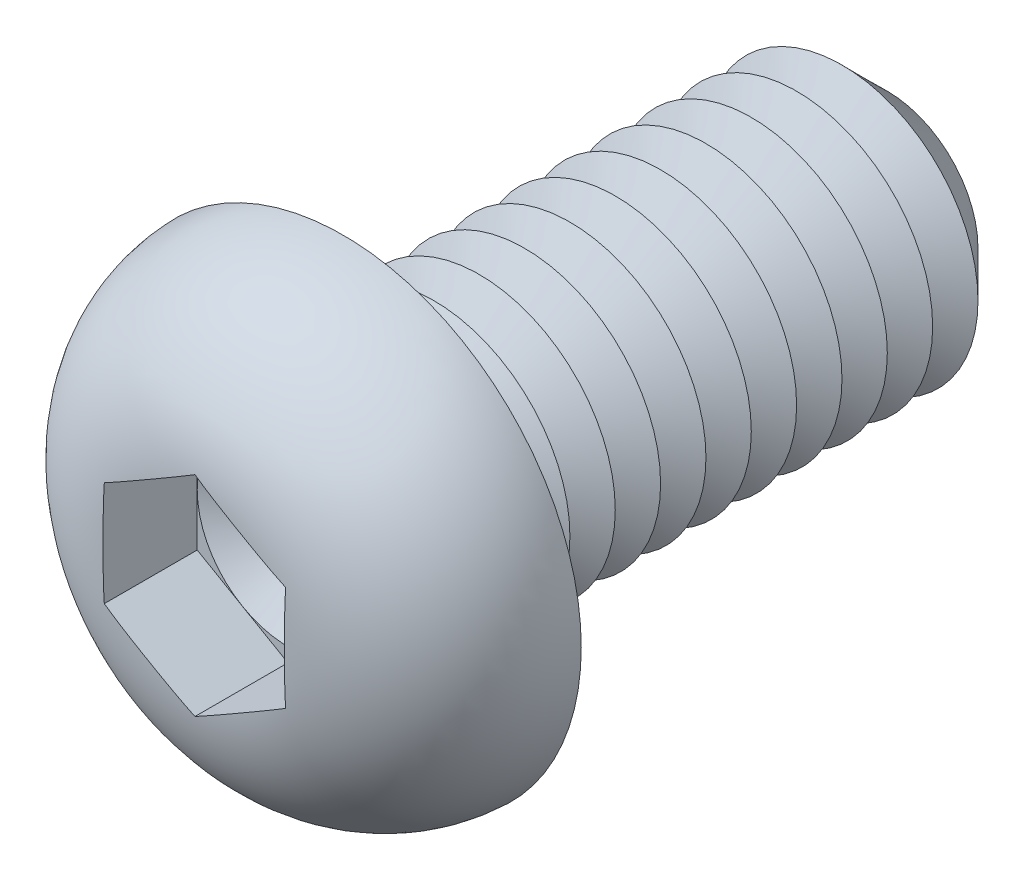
ISO-10303-21;
HEADER;
FILE_DESCRIPTION(('STEP AP214'),'2;1');
FILE_NAME('part.step','',(''),(''),'','','');
FILE_SCHEMA(('AUTOMOTIVE_DESIGN { 1 0 10303 214 1 1 1 1 }'));
ENDSEC;
DATA;
#1=APPLICATION_CONTEXT('core data for automotive mechanical design processes');
#2=APPLICATION_PROTOCOL_DEFINITION('international standard','automotive_design',2000,#1);
#3=PRODUCT_CONTEXT('',#1,'mechanical');
#4=PRODUCT('Part','Part','',(#3));
#5=PRODUCT_RELATED_PRODUCT_CATEGORY('part','',(#4));
#6=PRODUCT_DEFINITION_FORMATION('','',#4);
#7=PRODUCT_DEFINITION_CONTEXT('part definition',#1,'design');
#8=PRODUCT_DEFINITION('design','',#6,#7);
#9=PRODUCT_DEFINITION_SHAPE('','',#8);
#10=(LENGTH_UNIT() NAMED_UNIT(*) SI_UNIT(.MILLI.,.METRE.));
#11=(NAMED_UNIT(*) PLANE_ANGLE_UNIT() SI_UNIT($,.RADIAN.));
#12=(NAMED_UNIT(*) SI_UNIT($,.STERADIAN.) SOLID_ANGLE_UNIT());
#13=UNCERTAINTY_MEASURE_WITH_UNIT(LENGTH_MEASURE(1.E-05),#10,'distance_accuracy_value','');
#14=(GEOMETRIC_REPRESENTATION_CONTEXT(3) GLOBAL_UNCERTAINTY_ASSIGNED_CONTEXT((#13)) GLOBAL_UNIT_ASSIGNED_CONTEXT((#10,
#11,#12)) REPRESENTATION_CONTEXT('',''));
#15=CARTESIAN_POINT('',(0.,0.,0.));
#16=DIRECTION('',(0.,0.,1.));
#17=DIRECTION('',(1.,0.,0.));
#18=AXIS2_PLACEMENT_3D('',#15,#16,#17);
#19=CARTESIAN_POINT('',(0.,0.,1.22));
#20=DIRECTION('',(0.,0.,1.));
#21=DIRECTION('',(1.,0.,0.));
#22=AXIS2_PLACEMENT_3D('',#19,#20,#21);
#23=PLANE('',#22);
#24=CARTESIAN_POINT('',(0.,0.,1.22));
#25=DIRECTION('',(0.,0.,1.));
#26=DIRECTION('',(1.,0.,0.));
#27=AXIS2_PLACEMENT_3D('',#24,#25,#26);
#28=CIRCLE('',#27,2.);
#29=CARTESIAN_POINT('',(2.,0.,1.22));
#30=VERTEX_POINT('',#29);
#31=CARTESIAN_POINT('',(1.,1.73205080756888,1.22));
#32=VERTEX_POINT('',#31);
#33=EDGE_CURVE('E117',#30,#32,#28,.T.);
#34=ORIENTED_EDGE('',*,*,#33,.F.);
#35=DIRECTION('',(0.,1.,0.));
#36=VECTOR('',#35,1.);
#37=CARTESIAN_POINT('',(2.,-1.15470053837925,1.22));
#38=LINE('',#37,#36);
#39=CARTESIAN_POINT('',(2.,1.15470053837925,1.22));
#40=VERTEX_POINT('',#39);
#41=EDGE_CURVE('E140',#30,#40,#38,.T.);
#42=ORIENTED_EDGE('',*,*,#41,.T.);
#43=DIRECTION('',(-0.866025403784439,0.5,0.));
#44=VECTOR('',#43,1.);
#45=CARTESIAN_POINT('',(2.,1.15470053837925,1.22));
#46=LINE('',#45,#44);
#47=EDGE_CURVE('E136',#40,#32,#46,.T.);
#48=ORIENTED_EDGE('',*,*,#47,.T.);
#49=EDGE_LOOP('',(#34,#42,#48));
#50=FACE_BOUND('',#49,.T.);
#51=ADVANCED_FACE('F39',(#50),#23,.T.);
#52=CARTESIAN_POINT('',(0.,0.,1.22));
#53=DIRECTION('',(0.,0.,1.));
#54=DIRECTION('',(1.,0.,0.));
#55=AXIS2_PLACEMENT_3D('',#52,#53,#54);
#56=CIRCLE('',#55,2.);
#57=CARTESIAN_POINT('',(-1.,1.73205080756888,1.22));
#58=VERTEX_POINT('',#57);
#59=EDGE_CURVE('E11',#32,#58,#56,.T.);
#60=ORIENTED_EDGE('',*,*,#59,.F.);
#61=CARTESIAN_POINT('',(0.,2.3094010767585,1.22));
#62=VERTEX_POINT('',#61);
#63=EDGE_CURVE('E130',#32,#62,#46,.T.);
#64=ORIENTED_EDGE('',*,*,#63,.T.);
#65=DIRECTION('',(-0.866025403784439,-0.5,0.));
#66=VECTOR('',#65,1.);
#67=CARTESIAN_POINT('',(0.,2.3094010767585,1.22));
#68=LINE('',#67,#66);
#69=EDGE_CURVE('E131',#62,#58,#68,.T.);
#70=ORIENTED_EDGE('',*,*,#69,.T.);
#71=EDGE_LOOP('',(#60,#64,#70));
#72=FACE_BOUND('',#71,.T.);
#73=ADVANCED_FACE('F129',(#72),#23,.T.);
#74=CARTESIAN_POINT('',(-2.,0.,1.22));
#75=VERTEX_POINT('',#74);
#76=EDGE_CURVE('E49',#58,#75,#56,.T.);
#77=ORIENTED_EDGE('',*,*,#76,.F.);
#78=CARTESIAN_POINT('',(-2.,1.15470053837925,1.22));
#79=VERTEX_POINT('',#78);
#80=EDGE_CURVE('E143',#58,#79,#68,.T.);
#81=ORIENTED_EDGE('',*,*,#80,.T.);
#82=DIRECTION('',(0.,-1.,0.));
#83=VECTOR('',#82,1.);
#84=CARTESIAN_POINT('',(-2.,1.15470053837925,1.22));
#85=LINE('',#84,#83);
#86=EDGE_CURVE('E153',#79,#75,#85,.T.);
#87=ORIENTED_EDGE('',*,*,#86,.T.);
#88=EDGE_LOOP('',(#77,#81,#87));
#89=FACE_BOUND('',#88,.T.);
#90=ADVANCED_FACE('F270',(#89),#23,.T.);
#91=CARTESIAN_POINT('',(-1.,-1.73205080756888,1.22));
#92=VERTEX_POINT('',#91);
#93=EDGE_CURVE('E254',#75,#92,#56,.T.);
#94=ORIENTED_EDGE('',*,*,#93,.F.);
#95=CARTESIAN_POINT('',(-2.,-1.15470053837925,1.22));
#96=VERTEX_POINT('',#95);
#97=EDGE_CURVE('E152',#75,#96,#85,.T.);
#98=ORIENTED_EDGE('',*,*,#97,.T.);
#99=DIRECTION('',(0.866025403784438,-0.5,0.));
#100=VECTOR('',#99,1.);
#101=CARTESIAN_POINT('',(-2.,-1.15470053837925,1.22));
#102=LINE('',#101,#100);
#103=EDGE_CURVE('E158',#96,#92,#102,.T.);
#104=ORIENTED_EDGE('',*,*,#103,.T.);
#105=EDGE_LOOP('',(#94,#98,#104));
#106=FACE_BOUND('',#105,.T.);
#107=ADVANCED_FACE('F264',(#106),#23,.T.);
#108=CARTESIAN_POINT('',(0.999999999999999,-1.73205080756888,1.22));
#109=VERTEX_POINT('',#108);
#110=EDGE_CURVE('E56',#92,#109,#56,.T.);
#111=ORIENTED_EDGE('',*,*,#110,.F.);
#112=CARTESIAN_POINT('',(0.,-2.3094010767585,1.22));
#113=VERTEX_POINT('',#112);
#114=EDGE_CURVE('E157',#92,#113,#102,.T.);
#115=ORIENTED_EDGE('',*,*,#114,.T.);
#116=DIRECTION('',(0.866025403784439,0.5,0.));
#117=VECTOR('',#116,1.);
#118=CARTESIAN_POINT('',(0.,-2.3094010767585,1.22));
#119=LINE('',#118,#117);
#120=EDGE_CURVE('E163',#113,#109,#119,.T.);
#121=ORIENTED_EDGE('',*,*,#120,.T.);
#122=EDGE_LOOP('',(#111,#115,#121));
#123=FACE_BOUND('',#122,.T.);
#124=ADVANCED_FACE('F306',(#123),#23,.T.);
#125=CARTESIAN_POINT('',(0.,0.,-12.));
#126=DIRECTION('',(0.,0.,1.));
#127=DIRECTION('',(1.,0.,0.));
#128=AXIS2_PLACEMENT_3D('',#125,#126,#127);
#129=CYLINDRICAL_SURFACE('',#128,3.);
#130=CARTESIAN_POINT('',(0.,0.,-0.5));
#131=DIRECTION('',(0.,0.,1.));
#132=DIRECTION('',(1.,0.,0.));
#133=AXIS2_PLACEMENT_3D('',#130,#131,#132);
#134=CIRCLE('',#133,3.);
#135=CARTESIAN_POINT('',(3.,0.,-0.5));
#136=VERTEX_POINT('',#135);
#137=EDGE_CURVE('E242',#136,#136,#134,.F.);
#138=ORIENTED_EDGE('',*,*,#137,.T.);
#139=EDGE_LOOP('',(#138));
#140=FACE_BOUND('',#139,.T.);
#141=CARTESIAN_POINT('',(0.,0.,-1.));
#142=DIRECTION('',(0.,0.,1.));
#143=DIRECTION('',(1.,0.,0.));
#144=AXIS2_PLACEMENT_3D('',#141,#142,#143);
#145=CIRCLE('',#144,3.00000000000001);
#146=CARTESIAN_POINT('',(3.00000000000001,0.,-1.));
#147=VERTEX_POINT('',#146);
#148=EDGE_CURVE('E138',#147,#147,#145,.T.);
#149=ORIENTED_EDGE('',*,*,#148,.T.);
#150=EDGE_LOOP('',(#149));
#151=FACE_BOUND('',#150,.T.);
#152=ADVANCED_FACE('F307',(#140,#151),#129,.T.);
#153=CARTESIAN_POINT('',(0.,5.25,0.));
#154=DIRECTION('',(0.,0.,1.));
#155=DIRECTION('',(1.,0.,0.));
#156=AXIS2_PLACEMENT_3D('',#153,#154,#155);
#157=PLANE('',#156);
#158=CARTESIAN_POINT('',(0.,0.,0.));
#159=DIRECTION('',(0.,0.,1.));
#160=DIRECTION('',(1.,0.,0.));
#161=AXIS2_PLACEMENT_3D('',#158,#159,#160);
#162=CIRCLE('',#161,3.5);
#163=CARTESIAN_POINT('',(3.5,0.,0.));
#164=VERTEX_POINT('',#163);
#165=EDGE_CURVE('E245',#164,#164,#162,.T.);
#166=ORIENTED_EDGE('',*,*,#165,.T.);
#167=EDGE_LOOP('',(#166));
#168=FACE_BOUND('',#167,.T.);
#169=CARTESIAN_POINT('',(0.,0.,0.));
#170=DIRECTION('',(0.,0.,1.));
#171=DIRECTION('',(1.,0.,0.));
#172=AXIS2_PLACEMENT_3D('',#169,#170,#171);
#173=CIRCLE('',#172,5.25);
#174=CARTESIAN_POINT('',(5.25,0.,0.));
#175=VERTEX_POINT('',#174);
#176=EDGE_CURVE('E174',#175,#175,#173,.T.);
#177=ORIENTED_EDGE('',*,*,#176,.F.);
#178=EDGE_LOOP('',(#177));
#179=FACE_BOUND('',#178,.T.);
#180=ADVANCED_FACE('F310',(#168,#179),#157,.F.);
#181=CARTESIAN_POINT('',(0.,0.,-0.0999999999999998));
#182=DIRECTION('',(0.,0.,1.));
#183=DIRECTION('',(1.,0.,0.));
#184=AXIS2_PLACEMENT_3D('',#181,#182,#183);
#185=DEGENERATE_TOROIDAL_SURFACE('',#184,1.85147090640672,3.4,.T.);
#186=CARTESIAN_POINT('',(-2.0002,1.15458506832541,3.26900492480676));
#187=CARTESIAN_POINT('',(-1.91694658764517,1.20265144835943,3.27552708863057));
#188=CARTESIAN_POINT('',(-1.83362001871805,1.25076006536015,3.28041849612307));
#189=CARTESIAN_POINT('',(-1.66691146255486,1.34700929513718,3.28784569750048));
#190=CARTESIAN_POINT('',(-1.58352950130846,1.39514989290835,3.29038223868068));
#191=CARTESIAN_POINT('',(-1.4167967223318,1.49141310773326,3.29400753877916));
#192=CARTESIAN_POINT('',(-1.33344591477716,1.5395357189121,3.29509714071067));
#193=CARTESIAN_POINT('',(-1.16673007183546,1.63578915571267,3.29647051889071));
#194=CARTESIAN_POINT('',(-1.08336503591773,1.68391998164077,3.29675420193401));
#195=CARTESIAN_POINT('',(-0.916634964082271,1.78018163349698,3.29675420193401));
#196=CARTESIAN_POINT('',(-0.833269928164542,1.82831245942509,3.29647051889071));
#197=CARTESIAN_POINT('',(-0.666554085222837,1.92456589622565,3.29509714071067));
#198=CARTESIAN_POINT('',(-0.583203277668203,1.9726885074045,3.29400753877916));
#199=CARTESIAN_POINT('',(-0.416470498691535,2.06895172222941,3.29038223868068));
#200=CARTESIAN_POINT('',(-0.333088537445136,2.11709232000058,3.28784569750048));
#201=CARTESIAN_POINT('',(-0.166379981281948,2.21334154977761,3.28041849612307));
#202=CARTESIAN_POINT('',(-0.0830534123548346,2.26145016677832,3.27552708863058));
#203=CARTESIAN_POINT('',(0.000200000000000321,2.30951654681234,3.26900492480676));
#204=B_SPLINE_CURVE_WITH_KNOTS('',3,(#186,#187,#188,#189,#190,#191,#192,#193,#194,#195,#196,
#197,#198,#199,#200,#201,#202,#203),.UNSPECIFIED.,.F.,.F.,(4,2,2,2,2,2,2,2,4),(0.,
0.289010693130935,0.57792963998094,0.866680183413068,1.15546411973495,1.44424805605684,
1.73299859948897,2.02191754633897,2.31092823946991),.UNSPECIFIED.);
#205=CARTESIAN_POINT('',(-2.,1.15470053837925,3.26902062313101));
#206=VERTEX_POINT('',#205);
#207=CARTESIAN_POINT('',(1.70733705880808E-11,2.30940107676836,3.2690206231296));
#208=VERTEX_POINT('',#207);
#209=EDGE_CURVE('E196',#206,#208,#204,.T.);
#210=ORIENTED_EDGE('',*,*,#209,.T.);
#211=CARTESIAN_POINT('',(-0.000199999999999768,2.30951654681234,3.26900492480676));
#212=CARTESIAN_POINT('',(0.0830534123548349,2.26145016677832,3.27552708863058));
#213=CARTESIAN_POINT('',(0.166379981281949,2.21334154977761,3.28041849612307));
#214=CARTESIAN_POINT('',(0.333088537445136,2.11709232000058,3.28784569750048));
#215=CARTESIAN_POINT('',(0.416470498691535,2.06895172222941,3.29038223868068));
#216=CARTESIAN_POINT('',(0.583203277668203,1.9726885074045,3.29400753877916));
#217=CARTESIAN_POINT('',(0.666554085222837,1.92456589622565,3.29509714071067));
#218=CARTESIAN_POINT('',(0.833269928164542,1.82831245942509,3.29647051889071));
#219=CARTESIAN_POINT('',(0.916634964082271,1.78018163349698,3.29675420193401));
#220=CARTESIAN_POINT('',(1.08336503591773,1.68391998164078,3.29675420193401));
#221=CARTESIAN_POINT('',(1.16673007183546,1.63578915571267,3.29647051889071));
#222=CARTESIAN_POINT('',(1.33344591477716,1.5395357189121,3.29509714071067));
#223=CARTESIAN_POINT('',(1.4167967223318,1.49141310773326,3.29400753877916));
#224=CARTESIAN_POINT('',(1.58352950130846,1.39514989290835,3.29038223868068));
#225=CARTESIAN_POINT('',(1.66691146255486,1.34700929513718,3.28784569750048));
#226=CARTESIAN_POINT('',(1.83362001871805,1.25076006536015,3.28041849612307));
#227=CARTESIAN_POINT('',(1.91694658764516,1.20265144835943,3.27552708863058));
#228=CARTESIAN_POINT('',(2.0002,1.15458506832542,3.26900492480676));
#229=B_SPLINE_CURVE_WITH_KNOTS('',3,(#211,#212,#213,#214,#215,#216,#217,#218,#219,#220,#221,
#222,#223,#224,#225,#226,#227,#228),.UNSPECIFIED.,.F.,.F.,(4,2,2,2,2,2,2,2,4),(0.,
0.289010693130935,0.577929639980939,0.866680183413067,1.15546411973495,1.44424805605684,
1.73299859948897,2.02191754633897,2.31092823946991),.UNSPECIFIED.);
#230=CARTESIAN_POINT('',(2.,1.15470053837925,3.26902062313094));
#231=VERTEX_POINT('',#230);
#232=EDGE_CURVE('E225',#208,#231,#229,.T.);
#233=ORIENTED_EDGE('',*,*,#232,.T.);
#234=CARTESIAN_POINT('',(2.,0.,3.29675420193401));
#235=CARTESIAN_POINT('',(2.,-0.0838690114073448,3.29675159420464));
#236=CARTESIAN_POINT('',(2.,-0.167737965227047,3.29653427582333));
#237=CARTESIAN_POINT('',(2.,-0.335473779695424,3.29552217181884));
#238=CARTESIAN_POINT('',(2.,-0.419340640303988,3.29472737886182));
#239=CARTESIAN_POINT('',(2.,-0.587092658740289,3.29218243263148));
#240=CARTESIAN_POINT('',(2.,-0.670977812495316,3.29043194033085));
#241=CARTESIAN_POINT('',(2.,-0.838702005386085,3.28542814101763));
#242=CARTESIAN_POINT('',(2.,-0.922541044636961,3.28217483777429));
#243=CARTESIAN_POINT('',(2.,-1.173343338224,3.26923984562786));
#244=CARTESIAN_POINT('',(2.,-1.34017699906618,3.25638268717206));
#245=CARTESIAN_POINT('',(2.,-1.67225876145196,3.21731215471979));
#246=CARTESIAN_POINT('',(2.,-1.83750825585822,3.19111187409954));
#247=CARTESIAN_POINT('',(2.,-2.10571503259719,3.13417573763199));
#248=CARTESIAN_POINT('',(2.,-2.20973442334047,3.10844622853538));
#249=CARTESIAN_POINT('',(2.,-2.41562153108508,3.04936015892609));
#250=CARTESIAN_POINT('',(2.,-2.51748898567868,3.01600267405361));
#251=CARTESIAN_POINT('',(2.,-2.71832295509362,2.94120377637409));
#252=CARTESIAN_POINT('',(2.,-2.81728700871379,2.89975572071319));
#253=CARTESIAN_POINT('',(2.,-3.01134256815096,2.80859624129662));
#254=CARTESIAN_POINT('',(2.,-3.10643425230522,2.75888519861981));
#255=CARTESIAN_POINT('',(2.,-3.29253530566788,2.65079509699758));
#256=CARTESIAN_POINT('',(2.,-3.38350832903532,2.59235327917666));
#257=CARTESIAN_POINT('',(2.,-3.55964478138,2.46728791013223));
#258=CARTESIAN_POINT('',(2.,-3.64480873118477,2.40066509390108));
#259=CARTESIAN_POINT('',(2.,-3.80840353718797,2.25961603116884));
#260=CARTESIAN_POINT('',(2.,-3.88683504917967,2.18519054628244));
#261=CARTESIAN_POINT('',(2.,-4.03608847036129,2.02906828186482));
#262=CARTESIAN_POINT('',(2.,-4.106911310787,1.94737239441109));
#263=CARTESIAN_POINT('',(2.,-4.23287471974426,1.78665318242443));
#264=CARTESIAN_POINT('',(2.,-4.2888832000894,1.7083085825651));
#265=CARTESIAN_POINT('',(2.,-4.39372062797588,1.54691061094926));
#266=CARTESIAN_POINT('',(2.,-4.44254705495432,1.46385560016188));
#267=CARTESIAN_POINT('',(2.,-4.53249771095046,1.29375158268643));
#268=CARTESIAN_POINT('',(2.,-4.57362814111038,1.20670586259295));
#269=CARTESIAN_POINT('',(2.,-4.6478549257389,1.02924414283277));
#270=CARTESIAN_POINT('',(2.,-4.68094842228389,0.938826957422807));
#271=CARTESIAN_POINT('',(2.,-4.76413649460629,0.674747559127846));
#272=CARTESIAN_POINT('',(2.,-4.80368573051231,0.497625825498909));
#273=CARTESIAN_POINT('',(2.,-4.85179982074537,0.13932226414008));
#274=CARTESIAN_POINT('',(2.,-4.86036774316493,-0.0418591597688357));
#275=CARTESIAN_POINT('',(2.,-4.84642577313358,-0.399473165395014));
#276=CARTESIAN_POINT('',(2.,-4.82452156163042,-0.575929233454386));
#277=CARTESIAN_POINT('',(2.,-4.75142809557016,-0.922615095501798));
#278=CARTESIAN_POINT('',(2.,-4.70024536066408,-1.09284626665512));
#279=CARTESIAN_POINT('',(2.,-4.57020203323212,-1.42258491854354));
#280=CARTESIAN_POINT('',(2.,-4.49131097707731,-1.58208036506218));
#281=CARTESIAN_POINT('',(2.,-4.3083542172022,-1.8860021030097));
#282=CARTESIAN_POINT('',(2.,-4.2042742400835,-2.03041978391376));
#283=CARTESIAN_POINT('',(2.,-3.97174533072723,-2.30354399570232));
#284=CARTESIAN_POINT('',(2.,-3.84281347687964,-2.43183812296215));
#285=CARTESIAN_POINT('',(2.,-3.56631740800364,-2.66612298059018));
#286=CARTESIAN_POINT('',(2.,-3.41877418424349,-2.77213848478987));
#287=CARTESIAN_POINT('',(2.,-3.18261597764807,-2.91604941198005));
#288=CARTESIAN_POINT('',(2.,-3.09905663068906,-2.96247915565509));
#289=CARTESIAN_POINT('',(2.,-2.92856838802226,-3.04879370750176));
#290=CARTESIAN_POINT('',(2.,-2.84163827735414,-3.08867612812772));
#291=CARTESIAN_POINT('',(2.,-2.66495003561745,-3.16199567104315));
#292=CARTESIAN_POINT('',(2.,-2.57518752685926,-3.19542218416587));
#293=CARTESIAN_POINT('',(2.,-2.3936698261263,-3.25594506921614));
#294=CARTESIAN_POINT('',(2.,-2.30191676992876,-3.28304789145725));
#295=CARTESIAN_POINT('',(2.,-2.07265810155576,-3.34285611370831));
#296=CARTESIAN_POINT('',(2.,-1.93423373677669,-3.37205334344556));
#297=CARTESIAN_POINT('',(2.,-1.65546420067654,-3.419280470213));
#298=CARTESIAN_POINT('',(2.,-1.51511762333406,-3.43730169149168));
#299=CARTESIAN_POINT('',(2.,-1.23291689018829,-3.46473877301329));
#300=CARTESIAN_POINT('',(2.,-1.09105869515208,-3.47411015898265));
#301=CARTESIAN_POINT('',(2.,-0.807138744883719,-3.48717303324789));
#302=CARTESIAN_POINT('',(2.,-0.665077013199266,-3.4908651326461));
#303=CARTESIAN_POINT('',(2.,-0.451303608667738,-3.49429675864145));
#304=CARTESIAN_POINT('',(2.,-0.379602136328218,-3.49508825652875));
#305=CARTESIAN_POINT('',(2.,-0.236195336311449,-3.49619580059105));
#306=CARTESIAN_POINT('',(2.,-0.164490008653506,-3.49651184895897));
#307=CARTESIAN_POINT('',(2.,-0.0210718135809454,-3.49680708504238));
#308=CARTESIAN_POINT('',(2.,0.0506410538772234,-3.49678623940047));
#309=CARTESIAN_POINT('',(2.,0.194065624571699,-3.49639104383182));
#310=CARTESIAN_POINT('',(2.,0.265777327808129,-3.49601669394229));
#311=CARTESIAN_POINT('',(2.,0.480501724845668,-3.4941697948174));
#312=CARTESIAN_POINT('',(2.,0.623510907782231,-3.49197539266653));
#313=CARTESIAN_POINT('',(2.,0.909378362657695,-3.48318258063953));
#314=CARTESIAN_POINT('',(2.,1.05223667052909,-3.47658576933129));
#315=CARTESIAN_POINT('',(2.,1.30726724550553,-3.45800282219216));
#316=CARTESIAN_POINT('',(2.,1.41953767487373,-3.44745204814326));
#317=CARTESIAN_POINT('',(2.,1.64336701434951,-3.42020385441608));
#318=CARTESIAN_POINT('',(2.,1.75492585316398,-3.40350582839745));
#319=CARTESIAN_POINT('',(2.,1.97590795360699,-3.36293007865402));
#320=CARTESIAN_POINT('',(2.,2.08534088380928,-3.33910600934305));
#321=CARTESIAN_POINT('',(2.,2.30216001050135,-3.28336687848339));
#322=CARTESIAN_POINT('',(2.,2.40954602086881,-3.25145108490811));
#323=CARTESIAN_POINT('',(2.,2.62289868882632,-3.1784271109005));
#324=CARTESIAN_POINT('',(2.,2.72882262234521,-3.13719314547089));
#325=CARTESIAN_POINT('',(2.,2.93660837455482,-3.04548652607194));
#326=CARTESIAN_POINT('',(2.,3.03847031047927,-2.99501413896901));
#327=CARTESIAN_POINT('',(2.,3.23738754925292,-2.88459171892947));
#328=CARTESIAN_POINT('',(2.,3.33442546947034,-2.82461027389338));
#329=CARTESIAN_POINT('',(2.,3.52225616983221,-2.69545434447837));
#330=CARTESIAN_POINT('',(2.,3.61304636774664,-2.62627609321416));
#331=CARTESIAN_POINT('',(2.,3.77958578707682,-2.48563135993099));
#332=CARTESIAN_POINT('',(2.,3.85595570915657,-2.41489922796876));
#333=CARTESIAN_POINT('',(2.,4.00175744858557,-2.26661746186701));
#334=CARTESIAN_POINT('',(2.,4.07118992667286,-2.18906847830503));
#335=CARTESIAN_POINT('',(2.,4.20228235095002,-2.02784942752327));
#336=CARTESIAN_POINT('',(2.,4.26395450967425,-1.94418931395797));
#337=CARTESIAN_POINT('',(2.,4.37897455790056,-1.7713710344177));
#338=CARTESIAN_POINT('',(2.,4.43232318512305,-1.68221335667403));
#339=CARTESIAN_POINT('',(2.,4.5685109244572,-1.42722170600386));
#340=CARTESIAN_POINT('',(2.,4.64167742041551,-1.25607726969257));
#341=CARTESIAN_POINT('',(2.,4.75695354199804,-0.903699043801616));
#342=CARTESIAN_POINT('',(2.,4.79906366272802,-0.722465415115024));
#343=CARTESIAN_POINT('',(2.,4.84982785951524,-0.362243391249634));
#344=CARTESIAN_POINT('',(2.,4.85966759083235,-0.183422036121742));
#345=CARTESIAN_POINT('',(2.,4.84889099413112,0.17327689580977));
#346=CARTESIAN_POINT('',(2.,4.82827907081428,0.351154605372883));
#347=CARTESIAN_POINT('',(2.,4.75760776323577,0.699332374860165));
#348=CARTESIAN_POINT('',(2.,4.70780624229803,0.869684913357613));
#349=CARTESIAN_POINT('',(2.,4.58058971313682,1.199716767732));
#350=CARTESIAN_POINT('',(2.,4.50317623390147,1.35939667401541));
#351=CARTESIAN_POINT('',(2.,4.32230037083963,1.66542907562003));
#352=CARTESIAN_POINT('',(2.,4.21858077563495,1.81162931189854));
#353=CARTESIAN_POINT('',(2.,3.98879583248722,2.08527000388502));
#354=CARTESIAN_POINT('',(2.,3.86272429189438,2.21270524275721));
#355=CARTESIAN_POINT('',(2.,3.58743550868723,2.45020985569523));
#356=CARTESIAN_POINT('',(2.,3.43756474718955,2.55951924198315));
#357=CARTESIAN_POINT('',(2.,3.12282273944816,2.7535430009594));
#358=CARTESIAN_POINT('',(2.,2.95795742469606,2.83826704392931));
#359=CARTESIAN_POINT('',(2.,2.67096435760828,2.96064273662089));
#360=CARTESIAN_POINT('',(2.,2.55150855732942,3.00473766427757));
#361=CARTESIAN_POINT('',(2.,2.30905936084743,3.08191633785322));
#362=CARTESIAN_POINT('',(2.,2.18606487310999,3.11499664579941));
#363=CARTESIAN_POINT('',(2.,1.93761764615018,3.17114962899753));
#364=CARTESIAN_POINT('',(2.,1.8121607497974,3.19420352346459));
#365=CARTESIAN_POINT('',(2.,1.56000755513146,3.23170431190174));
#366=CARTESIAN_POINT('',(2.,1.43331126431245,3.24615125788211));
#367=CARTESIAN_POINT('',(2.,1.19785080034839,3.26676473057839));
#368=CARTESIAN_POINT('',(2.,1.08915974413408,3.27383022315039));
#369=CARTESIAN_POINT('',(2.,0.87159878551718,3.28448481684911));
#370=CARTESIAN_POINT('',(2.,0.762728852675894,3.28807324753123));
#371=CARTESIAN_POINT('',(2.,0.54488171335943,3.29312180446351));
#372=CARTESIAN_POINT('',(2.,0.435904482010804,3.29458062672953));
#373=CARTESIAN_POINT('',(2.,0.217951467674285,3.29639847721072));
#374=CARTESIAN_POINT('',(2.,0.108975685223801,3.29675759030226));
#375=CARTESIAN_POINT('',(2.,0.,3.29675420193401));
#376=B_SPLINE_CURVE_WITH_KNOTS('',3,(#234,#235,#236,#237,#238,#239,#240,#241,#242,#243,#244,
#245,#246,#247,#248,#249,#250,#251,#252,#253,#254,#255,#256,#257,#258,#259,#260,#261,#262,#263,
#264,#265,#266,#267,#268,#269,#270,#271,#272,#273,#274,#275,#276,#277,#278,#279,#280,#281,#282,
#283,#284,#285,#286,#287,#288,#289,#290,#291,#292,#293,#294,#295,#296,#297,#298,#299,#300,#301,
#302,#303,#304,#305,#306,#307,#308,#309,#310,#311,#312,#313,#314,#315,#316,#317,#318,#319,#320,
#321,#322,#323,#324,#325,#326,#327,#328,#329,#330,#331,#332,#333,#334,#335,#336,#337,#338,#339,
#340,#341,#342,#343,#344,#345,#346,#347,#348,#349,#350,#351,#352,#353,#354,#355,#356,#357,#358,
#359,#360,#361,#362,#363,#364,#365,#366,#367,#368,#369,#370,#371,#372,#373,#374,#375),
.UNSPECIFIED.,.T.,.F.,(4,2,2,2,2,2,2,2,2,2,2,2,2,2,2,2,2,2,2,2,2,2,2,2,2,2,2,2,2,2,2,2,2,2,2,2,
2,2,2,2,2,2,2,2,2,2,2,2,2,2,2,2,2,2,2,2,2,2,2,2,2,2,2,2,2,2,2,2,2,2,4),(0.,0.251606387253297,
0.503215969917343,0.754914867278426,1.00661313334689,1.50825543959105,2.00940643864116,
2.33061510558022,2.65186271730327,2.97337521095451,3.29487288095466,3.61880390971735,
3.94270585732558,4.26657621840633,4.59040689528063,4.8789527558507,5.16759964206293,
5.45601293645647,5.74452864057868,6.28608750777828,6.82759274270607,7.35848716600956,
7.8892634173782,8.42062506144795,8.95228851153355,9.49557283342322,10.0382497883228,
10.3247866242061,10.6114277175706,10.8985359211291,11.1853499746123,11.6091713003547,
12.0333212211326,12.4596400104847,12.8859129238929,13.1010304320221,13.316146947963,
13.5312847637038,13.746422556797,14.1754765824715,14.6043748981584,14.9425387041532,
15.2807358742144,15.6164481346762,15.9521907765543,16.2927694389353,16.6333382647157,
16.9750565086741,17.3169151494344,17.6287548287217,17.9405647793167,18.2518777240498,
18.5631630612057,19.1185081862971,19.6738444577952,20.20853386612,20.7431459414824,
21.2731049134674,21.8030345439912,22.3383600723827,22.8738341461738,23.4279697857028,
23.9818871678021,24.3633752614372,24.7449823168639,25.1273011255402,25.5096176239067,
25.8363061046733,26.163057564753,26.4900090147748,26.8169352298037),.UNSPECIFIED.);
#377=CARTESIAN_POINT('',(2.,-1.15470053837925,3.26902062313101));
#378=VERTEX_POINT('',#377);
#379=EDGE_CURVE('E234',#231,#378,#376,.T.);
#380=ORIENTED_EDGE('',*,*,#379,.T.);
#381=CARTESIAN_POINT('',(2.0002,-1.15458506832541,3.26900492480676));
#382=CARTESIAN_POINT('',(1.91694658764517,-1.20265144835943,3.27552708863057));
#383=CARTESIAN_POINT('',(1.83362001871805,-1.25076006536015,3.28041849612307));
#384=CARTESIAN_POINT('',(1.66691146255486,-1.34700929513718,3.28784569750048));
#385=CARTESIAN_POINT('',(1.58352950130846,-1.39514989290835,3.29038223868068));
#386=CARTESIAN_POINT('',(1.4167967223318,-1.49141310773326,3.29400753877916));
#387=CARTESIAN_POINT('',(1.33344591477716,-1.5395357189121,3.29509714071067));
#388=CARTESIAN_POINT('',(1.16673007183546,-1.63578915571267,3.29647051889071));
#389=CARTESIAN_POINT('',(1.08336503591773,-1.68391998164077,3.29675420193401));
#390=CARTESIAN_POINT('',(0.916634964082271,-1.78018163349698,3.29675420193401));
#391=CARTESIAN_POINT('',(0.833269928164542,-1.82831245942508,3.29647051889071));
#392=CARTESIAN_POINT('',(0.666554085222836,-1.92456589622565,3.29509714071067));
#393=CARTESIAN_POINT('',(0.583203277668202,-1.97268850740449,3.29400753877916));
#394=CARTESIAN_POINT('',(0.416470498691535,-2.06895172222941,3.29038223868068));
#395=CARTESIAN_POINT('',(0.333088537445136,-2.11709232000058,3.28784569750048));
#396=CARTESIAN_POINT('',(0.166379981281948,-2.2133415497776,3.28041849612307));
#397=CARTESIAN_POINT('',(0.0830534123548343,-2.26145016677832,3.27552708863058));
#398=CARTESIAN_POINT('',(-0.000200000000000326,-2.30951654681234,3.26900492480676));
#399=B_SPLINE_CURVE_WITH_KNOTS('',3,(#381,#382,#383,#384,#385,#386,#387,#388,#389,#390,#391,
#392,#393,#394,#395,#396,#397,#398),.UNSPECIFIED.,.F.,.F.,(4,2,2,2,2,2,2,2,4),(0.,
0.289010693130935,0.57792963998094,0.866680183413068,1.15546411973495,1.44424805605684,
1.73299859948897,2.02191754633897,2.31092823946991),.UNSPECIFIED.);
#400=CARTESIAN_POINT('',(0.,-2.3094010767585,3.26902062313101));
#401=VERTEX_POINT('',#400);
#402=EDGE_CURVE('E281',#378,#401,#399,.T.);
#403=ORIENTED_EDGE('',*,*,#402,.T.);
#404=CARTESIAN_POINT('',(0.000199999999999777,-2.30951654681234,3.26900492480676));
#405=CARTESIAN_POINT('',(-0.083053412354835,-2.26145016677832,3.27552708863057));
#406=CARTESIAN_POINT('',(-0.166379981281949,-2.21334154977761,3.28041849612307));
#407=CARTESIAN_POINT('',(-0.333088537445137,-2.11709232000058,3.28784569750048));
#408=CARTESIAN_POINT('',(-0.416470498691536,-2.06895172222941,3.29038223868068));
#409=CARTESIAN_POINT('',(-0.583203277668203,-1.97268850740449,3.29400753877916));
#410=CARTESIAN_POINT('',(-0.666554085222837,-1.92456589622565,3.29509714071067));
#411=CARTESIAN_POINT('',(-0.833269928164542,-1.82831245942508,3.29647051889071));
#412=CARTESIAN_POINT('',(-0.916634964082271,-1.78018163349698,3.29675420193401));
#413=CARTESIAN_POINT('',(-1.08336503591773,-1.68391998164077,3.29675420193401));
#414=CARTESIAN_POINT('',(-1.16673007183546,-1.63578915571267,3.29647051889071));
#415=CARTESIAN_POINT('',(-1.33344591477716,-1.5395357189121,3.29509714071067));
#416=CARTESIAN_POINT('',(-1.4167967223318,-1.49141310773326,3.29400753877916));
#417=CARTESIAN_POINT('',(-1.58352950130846,-1.39514989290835,3.29038223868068));
#418=CARTESIAN_POINT('',(-1.66691146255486,-1.34700929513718,3.28784569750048));
#419=CARTESIAN_POINT('',(-1.83362001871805,-1.25076006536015,3.28041849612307));
#420=CARTESIAN_POINT('',(-1.91694658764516,-1.20265144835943,3.27552708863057));
#421=CARTESIAN_POINT('',(-2.0002,-1.15458506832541,3.26900492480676));
#422=B_SPLINE_CURVE_WITH_KNOTS('',3,(#404,#405,#406,#407,#408,#409,#410,#411,#412,#413,#414,
#415,#416,#417,#418,#419,#420,#421),.UNSPECIFIED.,.F.,.F.,(4,2,2,2,2,2,2,2,4),(0.,
0.289010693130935,0.577929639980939,0.866680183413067,1.15546411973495,1.44424805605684,
1.73299859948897,2.02191754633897,2.31092823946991),.UNSPECIFIED.);
#423=CARTESIAN_POINT('',(-2.,-1.15470053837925,3.26902062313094));
#424=VERTEX_POINT('',#423);
#425=EDGE_CURVE('E277',#401,#424,#422,.T.);
#426=ORIENTED_EDGE('',*,*,#425,.T.);
#427=CARTESIAN_POINT('',(-2.,0.,3.29675420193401));
#428=CARTESIAN_POINT('',(-2.,0.0838690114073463,3.29675159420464));
#429=CARTESIAN_POINT('',(-2.,0.167737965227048,3.29653427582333));
#430=CARTESIAN_POINT('',(-2.,0.335473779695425,3.29552217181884));
#431=CARTESIAN_POINT('',(-2.,0.41934064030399,3.29472737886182));
#432=CARTESIAN_POINT('',(-2.,0.58709265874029,3.29218243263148));
#433=CARTESIAN_POINT('',(-2.,0.670977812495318,3.29043194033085));
#434=CARTESIAN_POINT('',(-2.,0.838702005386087,3.28542814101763));
#435=CARTESIAN_POINT('',(-2.,0.922541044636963,3.28217483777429));
#436=CARTESIAN_POINT('',(-2.,1.173343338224,3.26923984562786));
#437=CARTESIAN_POINT('',(-2.,1.34017699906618,3.25638268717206));
#438=CARTESIAN_POINT('',(-2.,1.67225876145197,3.21731215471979));
#439=CARTESIAN_POINT('',(-2.,1.83750825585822,3.19111187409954));
#440=CARTESIAN_POINT('',(-2.,2.10571503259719,3.13417573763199));
#441=CARTESIAN_POINT('',(-2.,2.20973442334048,3.10844622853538));
#442=CARTESIAN_POINT('',(-2.,2.41562153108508,3.04936015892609));
#443=CARTESIAN_POINT('',(-2.,2.51748898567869,3.01600267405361));
#444=CARTESIAN_POINT('',(-2.,2.71832295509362,2.94120377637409));
#445=CARTESIAN_POINT('',(-2.,2.81728700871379,2.89975572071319));
#446=CARTESIAN_POINT('',(-2.,3.01134256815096,2.80859624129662));
#447=CARTESIAN_POINT('',(-2.,3.10643425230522,2.75888519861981));
#448=CARTESIAN_POINT('',(-2.,3.29253530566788,2.65079509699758));
#449=CARTESIAN_POINT('',(-2.,3.38350832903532,2.59235327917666));
#450=CARTESIAN_POINT('',(-2.,3.55964478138,2.46728791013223));
#451=CARTESIAN_POINT('',(-2.,3.64480873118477,2.40066509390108));
#452=CARTESIAN_POINT('',(-2.,3.80840353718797,2.25961603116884));
#453=CARTESIAN_POINT('',(-2.,3.88683504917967,2.18519054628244));
#454=CARTESIAN_POINT('',(-2.,4.03608847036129,2.02906828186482));
#455=CARTESIAN_POINT('',(-2.,4.106911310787,1.94737239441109));
#456=CARTESIAN_POINT('',(-2.,4.23287471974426,1.78665318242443));
#457=CARTESIAN_POINT('',(-2.,4.2888832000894,1.7083085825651));
#458=CARTESIAN_POINT('',(-2.,4.39372062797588,1.54691061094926));
#459=CARTESIAN_POINT('',(-2.,4.44254705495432,1.46385560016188));
#460=CARTESIAN_POINT('',(-2.,4.53249771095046,1.29375158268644));
#461=CARTESIAN_POINT('',(-2.,4.57362814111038,1.20670586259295));
#462=CARTESIAN_POINT('',(-2.,4.6478549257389,1.02924414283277));
#463=CARTESIAN_POINT('',(-2.,4.68094842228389,0.938826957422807));
#464=CARTESIAN_POINT('',(-2.,4.76413649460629,0.674747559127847));
#465=CARTESIAN_POINT('',(-2.,4.80368573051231,0.497625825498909));
#466=CARTESIAN_POINT('',(-2.,4.85179982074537,0.13932226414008));
#467=CARTESIAN_POINT('',(-2.,4.86036774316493,-0.0418591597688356));
#468=CARTESIAN_POINT('',(-2.,4.84642577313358,-0.399473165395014));
#469=CARTESIAN_POINT('',(-2.,4.82452156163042,-0.575929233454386));
#470=CARTESIAN_POINT('',(-2.,4.75142809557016,-0.922615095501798));
#471=CARTESIAN_POINT('',(-2.,4.70024536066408,-1.09284626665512));
#472=CARTESIAN_POINT('',(-2.,4.57020203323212,-1.42258491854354));
#473=CARTESIAN_POINT('',(-2.,4.49131097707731,-1.58208036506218));
#474=CARTESIAN_POINT('',(-2.,4.3083542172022,-1.8860021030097));
#475=CARTESIAN_POINT('',(-2.,4.2042742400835,-2.03041978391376));
#476=CARTESIAN_POINT('',(-2.,3.97174533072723,-2.30354399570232));
#477=CARTESIAN_POINT('',(-2.,3.84281347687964,-2.43183812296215));
#478=CARTESIAN_POINT('',(-2.,3.56631740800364,-2.66612298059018));
#479=CARTESIAN_POINT('',(-2.,3.41877418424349,-2.77213848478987));
#480=CARTESIAN_POINT('',(-2.,3.18261597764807,-2.91604941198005));
#481=CARTESIAN_POINT('',(-2.,3.09905663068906,-2.96247915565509));
#482=CARTESIAN_POINT('',(-2.,2.92856838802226,-3.04879370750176));
#483=CARTESIAN_POINT('',(-2.,2.84163827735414,-3.08867612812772));
#484=CARTESIAN_POINT('',(-2.,2.66495003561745,-3.16199567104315));
#485=CARTESIAN_POINT('',(-2.,2.57518752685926,-3.19542218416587));
#486=CARTESIAN_POINT('',(-2.,2.3936698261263,-3.25594506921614));
#487=CARTESIAN_POINT('',(-2.,2.30191676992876,-3.28304789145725));
#488=CARTESIAN_POINT('',(-2.,2.07265810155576,-3.34285611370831));
#489=CARTESIAN_POINT('',(-2.,1.93423373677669,-3.37205334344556));
#490=CARTESIAN_POINT('',(-2.,1.65546420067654,-3.419280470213));
#491=CARTESIAN_POINT('',(-2.,1.51511762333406,-3.43730169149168));
#492=CARTESIAN_POINT('',(-2.,1.23291689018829,-3.46473877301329));
#493=CARTESIAN_POINT('',(-2.,1.09105869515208,-3.47411015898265));
#494=CARTESIAN_POINT('',(-2.,0.807138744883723,-3.48717303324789));
#495=CARTESIAN_POINT('',(-2.,0.66507701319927,-3.4908651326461));
#496=CARTESIAN_POINT('',(-2.,0.451303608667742,-3.49429675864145));
#497=CARTESIAN_POINT('',(-2.,0.379602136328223,-3.49508825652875));
#498=CARTESIAN_POINT('',(-2.,0.236195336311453,-3.49619580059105));
#499=CARTESIAN_POINT('',(-2.,0.16449000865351,-3.49651184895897));
#500=CARTESIAN_POINT('',(-2.,0.0210718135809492,-3.49680708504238));
#501=CARTESIAN_POINT('',(-2.,-0.0506410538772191,-3.49678623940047));
#502=CARTESIAN_POINT('',(-2.,-0.194065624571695,-3.49639104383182));
#503=CARTESIAN_POINT('',(-2.,-0.265777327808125,-3.49601669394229));
#504=CARTESIAN_POINT('',(-2.,-0.480501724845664,-3.4941697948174));
#505=CARTESIAN_POINT('',(-2.,-0.623510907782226,-3.49197539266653));
#506=CARTESIAN_POINT('',(-2.,-0.909378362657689,-3.48318258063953));
#507=CARTESIAN_POINT('',(-2.,-1.05223667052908,-3.47658576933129));
#508=CARTESIAN_POINT('',(-2.,-1.30726724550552,-3.45800282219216));
#509=CARTESIAN_POINT('',(-2.,-1.41953767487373,-3.44745204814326));
#510=CARTESIAN_POINT('',(-2.,-1.6433670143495,-3.42020385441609));
#511=CARTESIAN_POINT('',(-2.,-1.75492585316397,-3.40350582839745));
#512=CARTESIAN_POINT('',(-2.,-1.97590795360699,-3.36293007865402));
#513=CARTESIAN_POINT('',(-2.,-2.08534088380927,-3.33910600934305));
#514=CARTESIAN_POINT('',(-2.,-2.30216001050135,-3.28336687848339));
#515=CARTESIAN_POINT('',(-2.,-2.4095460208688,-3.25145108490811));
#516=CARTESIAN_POINT('',(-2.,-2.62289868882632,-3.1784271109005));
#517=CARTESIAN_POINT('',(-2.,-2.72882262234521,-3.13719314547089));
#518=CARTESIAN_POINT('',(-2.,-2.93660837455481,-3.04548652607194));
#519=CARTESIAN_POINT('',(-2.,-3.03847031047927,-2.99501413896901));
#520=CARTESIAN_POINT('',(-2.,-3.23738754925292,-2.88459171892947));
#521=CARTESIAN_POINT('',(-2.,-3.33442546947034,-2.82461027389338));
#522=CARTESIAN_POINT('',(-2.,-3.52225616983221,-2.69545434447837));
#523=CARTESIAN_POINT('',(-2.,-3.61304636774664,-2.62627609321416));
#524=CARTESIAN_POINT('',(-2.,-3.77958578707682,-2.48563135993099));
#525=CARTESIAN_POINT('',(-2.,-3.85595570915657,-2.41489922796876));
#526=CARTESIAN_POINT('',(-2.,-4.00175744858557,-2.26661746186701));
#527=CARTESIAN_POINT('',(-2.,-4.07118992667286,-2.18906847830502));
#528=CARTESIAN_POINT('',(-2.,-4.20228235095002,-2.02784942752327));
#529=CARTESIAN_POINT('',(-2.,-4.26395450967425,-1.94418931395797));
#530=CARTESIAN_POINT('',(-2.,-4.37897455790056,-1.7713710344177));
#531=CARTESIAN_POINT('',(-2.,-4.43232318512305,-1.68221335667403));
#532=CARTESIAN_POINT('',(-2.,-4.5685109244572,-1.42722170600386));
#533=CARTESIAN_POINT('',(-2.,-4.64167742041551,-1.25607726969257));
#534=CARTESIAN_POINT('',(-2.,-4.75695354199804,-0.903699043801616));
#535=CARTESIAN_POINT('',(-2.,-4.79906366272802,-0.722465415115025));
#536=CARTESIAN_POINT('',(-2.,-4.84982785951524,-0.362243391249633));
#537=CARTESIAN_POINT('',(-2.,-4.85966759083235,-0.18342203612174));
#538=CARTESIAN_POINT('',(-2.,-4.84889099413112,0.173276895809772));
#539=CARTESIAN_POINT('',(-2.,-4.82827907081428,0.351154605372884));
#540=CARTESIAN_POINT('',(-2.,-4.75760776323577,0.699332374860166));
#541=CARTESIAN_POINT('',(-2.,-4.70780624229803,0.869684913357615));
#542=CARTESIAN_POINT('',(-2.,-4.58058971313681,1.199716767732));
#543=CARTESIAN_POINT('',(-2.,-4.50317623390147,1.35939667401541));
#544=CARTESIAN_POINT('',(-2.,-4.32230037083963,1.66542907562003));
#545=CARTESIAN_POINT('',(-2.,-4.21858077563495,1.81162931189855));
#546=CARTESIAN_POINT('',(-2.,-3.98879583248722,2.08527000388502));
#547=CARTESIAN_POINT('',(-2.,-3.86272429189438,2.21270524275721));
#548=CARTESIAN_POINT('',(-2.,-3.58743550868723,2.45020985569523));
#549=CARTESIAN_POINT('',(-2.,-3.43756474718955,2.55951924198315));
#550=CARTESIAN_POINT('',(-2.,-3.12282273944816,2.7535430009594));
#551=CARTESIAN_POINT('',(-2.,-2.95795742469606,2.8382670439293));
#552=CARTESIAN_POINT('',(-2.,-2.67096435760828,2.96064273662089));
#553=CARTESIAN_POINT('',(-2.,-2.55150855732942,3.00473766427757));
#554=CARTESIAN_POINT('',(-2.,-2.30905936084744,3.08191633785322));
#555=CARTESIAN_POINT('',(-2.,-2.18606487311,3.11499664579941));
#556=CARTESIAN_POINT('',(-2.,-1.93761764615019,3.17114962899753));
#557=CARTESIAN_POINT('',(-2.,-1.81216074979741,3.19420352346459));
#558=CARTESIAN_POINT('',(-2.,-1.56000755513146,3.23170431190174));
#559=CARTESIAN_POINT('',(-2.,-1.43331126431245,3.24615125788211));
#560=CARTESIAN_POINT('',(-2.,-1.19785080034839,3.26676473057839));
#561=CARTESIAN_POINT('',(-2.,-1.08915974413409,3.27383022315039));
#562=CARTESIAN_POINT('',(-2.,-0.871598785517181,3.28448481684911));
#563=CARTESIAN_POINT('',(-2.,-0.762728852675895,3.28807324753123));
#564=CARTESIAN_POINT('',(-2.,-0.54488171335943,3.29312180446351));
#565=CARTESIAN_POINT('',(-2.,-0.435904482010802,3.29458062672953));
#566=CARTESIAN_POINT('',(-2.,-0.217951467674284,3.29639847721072));
#567=CARTESIAN_POINT('',(-2.,-0.108975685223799,3.29675759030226));
#568=CARTESIAN_POINT('',(-2.,0.,3.29675420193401));
#569=B_SPLINE_CURVE_WITH_KNOTS('',3,(#427,#428,#429,#430,#431,#432,#433,#434,#435,#436,#437,
#438,#439,#440,#441,#442,#443,#444,#445,#446,#447,#448,#449,#450,#451,#452,#453,#454,#455,#456,
#457,#458,#459,#460,#461,#462,#463,#464,#465,#466,#467,#468,#469,#470,#471,#472,#473,#474,#475,
#476,#477,#478,#479,#480,#481,#482,#483,#484,#485,#486,#487,#488,#489,#490,#491,#492,#493,#494,
#495,#496,#497,#498,#499,#500,#501,#502,#503,#504,#505,#506,#507,#508,#509,#510,#511,#512,#513,
#514,#515,#516,#517,#518,#519,#520,#521,#522,#523,#524,#525,#526,#527,#528,#529,#530,#531,#532,
#533,#534,#535,#536,#537,#538,#539,#540,#541,#542,#543,#544,#545,#546,#547,#548,#549,#550,#551,
#552,#553,#554,#555,#556,#557,#558,#559,#560,#561,#562,#563,#564,#565,#566,#567,#568),
.UNSPECIFIED.,.T.,.F.,(4,2,2,2,2,2,2,2,2,2,2,2,2,2,2,2,2,2,2,2,2,2,2,2,2,2,2,2,2,2,2,2,2,2,2,2,
2,2,2,2,2,2,2,2,2,2,2,2,2,2,2,2,2,2,2,2,2,2,2,2,2,2,2,2,2,2,2,2,2,2,4),(0.,0.251606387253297,
0.503215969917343,0.754914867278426,1.0066131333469,1.50825543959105,2.00940643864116,
2.33061510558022,2.65186271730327,2.97337521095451,3.29487288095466,3.61880390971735,
3.94270585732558,4.26657621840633,4.59040689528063,4.8789527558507,5.16759964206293,
5.45601293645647,5.74452864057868,6.28608750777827,6.82759274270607,7.35848716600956,
7.88926341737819,8.42062506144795,8.95228851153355,9.49557283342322,10.0382497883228,
10.3247866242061,10.6114277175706,10.8985359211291,11.1853499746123,11.6091713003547,
12.0333212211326,12.4596400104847,12.8859129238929,13.1010304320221,13.316146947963,
13.5312847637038,13.746422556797,14.1754765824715,14.6043748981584,14.9425387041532,
15.2807358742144,15.6164481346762,15.9521907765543,16.2927694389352,16.6333382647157,
16.9750565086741,17.3169151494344,17.6287548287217,17.9405647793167,18.2518777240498,
18.5631630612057,19.1185081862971,19.6738444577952,20.20853386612,20.7431459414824,
21.2731049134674,21.8030345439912,22.3383600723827,22.8738341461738,23.4279697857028,
23.981887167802,24.3633752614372,24.7449823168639,25.1273011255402,25.5096176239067,
25.8363061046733,26.163057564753,26.4900090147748,26.8169352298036),.UNSPECIFIED.);
#570=EDGE_CURVE('E205',#424,#206,#569,.T.);
#571=ORIENTED_EDGE('',*,*,#570,.T.);
#572=EDGE_LOOP('',(#210,#233,#380,#403,#426,#571));
#573=FACE_BOUND('',#572,.T.);
#574=ORIENTED_EDGE('',*,*,#176,.T.);
#575=EDGE_LOOP('',(#574));
#576=FACE_BOUND('',#575,.T.);
#577=ADVANCED_FACE('F210',(#573,#576),#185,.T.);
#578=CARTESIAN_POINT('',(2.,1.15470053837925,1.22));
#579=DIRECTION('',(0.5,0.866025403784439,0.));
#580=DIRECTION('',(-0.866025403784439,0.5,0.));
#581=AXIS2_PLACEMENT_3D('',#578,#579,#580);
#582=PLANE('',#581);
#583=DIRECTION('',(0.,0.,1.));
#584=VECTOR('',#583,1.);
#585=CARTESIAN_POINT('',(0.,2.3094010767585,1.22));
#586=LINE('',#585,#584);
#587=EDGE_CURVE('E64',#62,#208,#586,.T.);
#588=ORIENTED_EDGE('',*,*,#587,.F.);
#589=ORIENTED_EDGE('',*,*,#63,.F.);
#590=ORIENTED_EDGE('',*,*,#47,.F.);
#591=DIRECTION('',(0.,0.,1.));
#592=VECTOR('',#591,1.);
#593=CARTESIAN_POINT('',(2.,1.15470053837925,1.22));
#594=LINE('',#593,#592);
#595=EDGE_CURVE('E171',#40,#231,#594,.T.);
#596=ORIENTED_EDGE('',*,*,#595,.T.);
#597=ORIENTED_EDGE('',*,*,#232,.F.);
#598=EDGE_LOOP('',(#588,#589,#590,#596,#597));
#599=FACE_BOUND('',#598,.T.);
#600=ADVANCED_FACE('F134',(#599),#582,.F.);
#601=CARTESIAN_POINT('',(2.,-1.15470053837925,1.22));
#602=DIRECTION('',(1.,0.,0.));
#603=DIRECTION('',(0.,1.,0.));
#604=AXIS2_PLACEMENT_3D('',#601,#602,#603);
#605=PLANE('',#604);
#606=ORIENTED_EDGE('',*,*,#595,.F.);
#607=ORIENTED_EDGE('',*,*,#41,.F.);
#608=CARTESIAN_POINT('',(2.,-1.15470053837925,1.22));
#609=VERTEX_POINT('',#608);
#610=EDGE_CURVE('E167',#609,#30,#38,.T.);
#611=ORIENTED_EDGE('',*,*,#610,.F.);
#612=DIRECTION('',(0.,0.,1.));
#613=VECTOR('',#612,1.);
#614=CARTESIAN_POINT('',(2.,-1.15470053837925,1.22));
#615=LINE('',#614,#613);
#616=EDGE_CURVE('E175',#609,#378,#615,.T.);
#617=ORIENTED_EDGE('',*,*,#616,.T.);
#618=ORIENTED_EDGE('',*,*,#379,.F.);
#619=EDGE_LOOP('',(#606,#607,#611,#617,#618));
#620=FACE_BOUND('',#619,.T.);
#621=ADVANCED_FACE('F223',(#620),#605,.F.);
#622=CARTESIAN_POINT('',(0.,-2.3094010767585,1.22));
#623=DIRECTION('',(0.5,-0.866025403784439,0.));
#624=DIRECTION('',(0.866025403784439,0.5,0.));
#625=AXIS2_PLACEMENT_3D('',#622,#623,#624);
#626=PLANE('',#625);
#627=ORIENTED_EDGE('',*,*,#616,.F.);
#628=EDGE_CURVE('E162',#109,#609,#119,.T.);
#629=ORIENTED_EDGE('',*,*,#628,.F.);
#630=ORIENTED_EDGE('',*,*,#120,.F.);
#631=DIRECTION('',(0.,0.,1.));
#632=VECTOR('',#631,1.);
#633=CARTESIAN_POINT('',(0.,-2.3094010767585,1.22));
#634=LINE('',#633,#632);
#635=EDGE_CURVE('E179',#113,#401,#634,.T.);
#636=ORIENTED_EDGE('',*,*,#635,.T.);
#637=ORIENTED_EDGE('',*,*,#402,.F.);
#638=EDGE_LOOP('',(#627,#629,#630,#636,#637));
#639=FACE_BOUND('',#638,.T.);
#640=ADVANCED_FACE('F293',(#639),#626,.F.);
#641=CARTESIAN_POINT('',(-2.,-1.15470053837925,1.22));
#642=DIRECTION('',(-0.5,-0.866025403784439,0.));
#643=DIRECTION('',(0.866025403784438,-0.5,0.));
#644=AXIS2_PLACEMENT_3D('',#641,#642,#643);
#645=PLANE('',#644);
#646=ORIENTED_EDGE('',*,*,#635,.F.);
#647=ORIENTED_EDGE('',*,*,#114,.F.);
#648=ORIENTED_EDGE('',*,*,#103,.F.);
#649=DIRECTION('',(0.,0.,1.));
#650=VECTOR('',#649,1.);
#651=CARTESIAN_POINT('',(-2.,-1.15470053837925,1.22));
#652=LINE('',#651,#650);
#653=EDGE_CURVE('E183',#96,#424,#652,.T.);
#654=ORIENTED_EDGE('',*,*,#653,.T.);
#655=ORIENTED_EDGE('',*,*,#425,.F.);
#656=EDGE_LOOP('',(#646,#647,#648,#654,#655));
#657=FACE_BOUND('',#656,.T.);
#658=ADVANCED_FACE('F290',(#657),#645,.F.);
#659=CARTESIAN_POINT('',(-2.,1.15470053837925,1.22));
#660=DIRECTION('',(-1.,0.,0.));
#661=DIRECTION('',(0.,-1.,0.));
#662=AXIS2_PLACEMENT_3D('',#659,#660,#661);
#663=PLANE('',#662);
#664=ORIENTED_EDGE('',*,*,#653,.F.);
#665=ORIENTED_EDGE('',*,*,#97,.F.);
#666=ORIENTED_EDGE('',*,*,#86,.F.);
#667=DIRECTION('',(0.,0.,1.));
#668=VECTOR('',#667,1.);
#669=CARTESIAN_POINT('',(-2.,1.15470053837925,1.22));
#670=LINE('',#669,#668);
#671=EDGE_CURVE('E187',#79,#206,#670,.T.);
#672=ORIENTED_EDGE('',*,*,#671,.T.);
#673=ORIENTED_EDGE('',*,*,#570,.F.);
#674=EDGE_LOOP('',(#664,#665,#666,#672,#673));
#675=FACE_BOUND('',#674,.T.);
#676=ADVANCED_FACE('F218',(#675),#663,.F.);
#677=CARTESIAN_POINT('',(0.,2.3094010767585,1.22));
#678=DIRECTION('',(-0.5,0.866025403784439,0.));
#679=DIRECTION('',(-0.866025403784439,-0.5,0.));
#680=AXIS2_PLACEMENT_3D('',#677,#678,#679);
#681=PLANE('',#680);
#682=ORIENTED_EDGE('',*,*,#671,.F.);
#683=ORIENTED_EDGE('',*,*,#80,.F.);
#684=ORIENTED_EDGE('',*,*,#69,.F.);
#685=ORIENTED_EDGE('',*,*,#587,.T.);
#686=ORIENTED_EDGE('',*,*,#209,.F.);
#687=EDGE_LOOP('',(#682,#683,#684,#685,#686));
#688=FACE_BOUND('',#687,.T.);
#689=ADVANCED_FACE('F214',(#688),#681,.F.);
#690=EDGE_CURVE('E43',#109,#30,#56,.T.);
#691=ORIENTED_EDGE('',*,*,#690,.F.);
#692=ORIENTED_EDGE('',*,*,#628,.T.);
#693=ORIENTED_EDGE('',*,*,#610,.T.);
#694=EDGE_LOOP('',(#691,#692,#693));
#695=FACE_BOUND('',#694,.T.);
#696=ADVANCED_FACE('F217',(#695),#23,.T.);
#697=CARTESIAN_POINT('',(0.,0.,-1.));
#698=DIRECTION('',(0.,0.,1.));
#699=DIRECTION('',(1.,0.,0.));
#700=AXIS2_PLACEMENT_3D('',#697,#698,#699);
#701=CONICAL_SURFACE('',#700,3.00000000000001,1.0471975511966);
#702=CARTESIAN_POINT('',(0.,0.,-1.5));
#703=DIRECTION('',(0.,0.,1.));
#704=DIRECTION('',(1.,0.,0.));
#705=AXIS2_PLACEMENT_3D('',#702,#703,#704);
#706=CIRCLE('',#705,2.13397459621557);
#707=CARTESIAN_POINT('',(2.13397459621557,0.,-1.5));
#708=VERTEX_POINT('',#707);
#709=EDGE_CURVE('E486',#708,#708,#706,.T.);
#710=ORIENTED_EDGE('',*,*,#709,.T.);
#711=EDGE_LOOP('',(#710));
#712=FACE_BOUND('',#711,.T.);
#713=ORIENTED_EDGE('',*,*,#148,.F.);
#714=EDGE_LOOP('',(#713));
#715=FACE_BOUND('',#714,.T.);
#716=ADVANCED_FACE('F304',(#712,#715),#701,.T.);
#717=CARTESIAN_POINT('',(0.,0.,-1.5));
#718=DIRECTION('',(0.,0.,-1.));
#719=DIRECTION('',(-1.,0.,0.));
#720=AXIS2_PLACEMENT_3D('',#717,#718,#719);
#721=CONICAL_SURFACE('',#720,2.13397459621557,1.0471975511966);
#722=CARTESIAN_POINT('',(0.,0.,-2.));
#723=DIRECTION('',(0.,0.,1.));
#724=DIRECTION('',(1.,0.,0.));
#725=AXIS2_PLACEMENT_3D('',#722,#723,#724);
#726=CIRCLE('',#725,3.00000000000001);
#727=CARTESIAN_POINT('',(3.00000000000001,0.,-2.));
#728=VERTEX_POINT('',#727);
#729=EDGE_CURVE('E484',#728,#728,#726,.T.);
#730=ORIENTED_EDGE('',*,*,#729,.T.);
#731=EDGE_LOOP('',(#730));
#732=FACE_BOUND('',#731,.T.);
#733=ORIENTED_EDGE('',*,*,#709,.F.);
#734=EDGE_LOOP('',(#733));
#735=FACE_BOUND('',#734,.T.);
#736=ADVANCED_FACE('F320',(#732,#735),#721,.T.);
#737=CARTESIAN_POINT('',(0.,0.,-2.));
#738=DIRECTION('',(0.,0.,1.));
#739=DIRECTION('',(1.,0.,0.));
#740=AXIS2_PLACEMENT_3D('',#737,#738,#739);
#741=CONICAL_SURFACE('',#740,3.00000000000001,1.0471975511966);
#742=CARTESIAN_POINT('',(0.,0.,-2.5));
#743=DIRECTION('',(0.,0.,1.));
#744=DIRECTION('',(1.,0.,0.));
#745=AXIS2_PLACEMENT_3D('',#742,#743,#744);
#746=CIRCLE('',#745,2.13397459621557);
#747=CARTESIAN_POINT('',(2.13397459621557,0.,-2.5));
#748=VERTEX_POINT('',#747);
#749=EDGE_CURVE('E481',#748,#748,#746,.T.);
#750=ORIENTED_EDGE('',*,*,#749,.T.);
#751=EDGE_LOOP('',(#750));
#752=FACE_BOUND('',#751,.T.);
#753=ORIENTED_EDGE('',*,*,#729,.F.);
#754=EDGE_LOOP('',(#753));
#755=FACE_BOUND('',#754,.T.);
#756=ADVANCED_FACE('F324',(#752,#755),#741,.T.);
#757=CARTESIAN_POINT('',(0.,0.,-2.5));
#758=DIRECTION('',(0.,0.,-1.));
#759=DIRECTION('',(-1.,0.,0.));
#760=AXIS2_PLACEMENT_3D('',#757,#758,#759);
#761=CONICAL_SURFACE('',#760,2.13397459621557,1.0471975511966);
#762=CARTESIAN_POINT('',(0.,0.,-3.));
#763=DIRECTION('',(0.,0.,1.));
#764=DIRECTION('',(1.,0.,0.));
#765=AXIS2_PLACEMENT_3D('',#762,#763,#764);
#766=CIRCLE('',#765,3.00000000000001);
#767=CARTESIAN_POINT('',(3.00000000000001,0.,-3.));
#768=VERTEX_POINT('',#767);
#769=EDGE_CURVE('E423',#768,#768,#766,.T.);
#770=ORIENTED_EDGE('',*,*,#769,.T.);
#771=EDGE_LOOP('',(#770));
#772=FACE_BOUND('',#771,.T.);
#773=ORIENTED_EDGE('',*,*,#749,.F.);
#774=EDGE_LOOP('',(#773));
#775=FACE_BOUND('',#774,.T.);
#776=ADVANCED_FACE('F328',(#772,#775),#761,.T.);
#777=CARTESIAN_POINT('',(0.,0.,-3.));
#778=DIRECTION('',(0.,0.,1.));
#779=DIRECTION('',(1.,0.,0.));
#780=AXIS2_PLACEMENT_3D('',#777,#778,#779);
#781=CONICAL_SURFACE('',#780,3.00000000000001,1.0471975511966);
#782=CARTESIAN_POINT('',(0.,0.,-3.5));
#783=DIRECTION('',(0.,0.,1.));
#784=DIRECTION('',(1.,0.,0.));
#785=AXIS2_PLACEMENT_3D('',#782,#783,#784);
#786=CIRCLE('',#785,2.13397459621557);
#787=CARTESIAN_POINT('',(2.13397459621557,0.,-3.5));
#788=VERTEX_POINT('',#787);
#789=EDGE_CURVE('E420',#788,#788,#786,.T.);
#790=ORIENTED_EDGE('',*,*,#789,.T.);
#791=EDGE_LOOP('',(#790));
#792=FACE_BOUND('',#791,.T.);
#793=ORIENTED_EDGE('',*,*,#769,.F.);
#794=EDGE_LOOP('',(#793));
#795=FACE_BOUND('',#794,.T.);
#796=ADVANCED_FACE('F332',(#792,#795),#781,.T.);
#797=CARTESIAN_POINT('',(0.,0.,-3.5));
#798=DIRECTION('',(0.,0.,-1.));
#799=DIRECTION('',(-1.,0.,0.));
#800=AXIS2_PLACEMENT_3D('',#797,#798,#799);
#801=CONICAL_SURFACE('',#800,2.13397459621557,1.0471975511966);
#802=CARTESIAN_POINT('',(0.,0.,-4.));
#803=DIRECTION('',(0.,0.,1.));
#804=DIRECTION('',(1.,0.,0.));
#805=AXIS2_PLACEMENT_3D('',#802,#803,#804);
#806=CIRCLE('',#805,3.00000000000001);
#807=CARTESIAN_POINT('',(3.00000000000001,0.,-4.));
#808=VERTEX_POINT('',#807);
#809=EDGE_CURVE('E424',#808,#808,#806,.T.);
#810=ORIENTED_EDGE('',*,*,#809,.T.);
#811=EDGE_LOOP('',(#810));
#812=FACE_BOUND('',#811,.T.);
#813=ORIENTED_EDGE('',*,*,#789,.F.);
#814=EDGE_LOOP('',(#813));
#815=FACE_BOUND('',#814,.T.);
#816=ADVANCED_FACE('F336',(#812,#815),#801,.T.);
#817=CARTESIAN_POINT('',(0.,0.,-4.));
#818=DIRECTION('',(0.,0.,1.));
#819=DIRECTION('',(1.,0.,0.));
#820=AXIS2_PLACEMENT_3D('',#817,#818,#819);
#821=CONICAL_SURFACE('',#820,3.00000000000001,1.0471975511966);
#822=CARTESIAN_POINT('',(0.,0.,-4.5));
#823=DIRECTION('',(0.,0.,1.));
#824=DIRECTION('',(1.,0.,0.));
#825=AXIS2_PLACEMENT_3D('',#822,#823,#824);
#826=CIRCLE('',#825,2.13397459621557);
#827=CARTESIAN_POINT('',(2.13397459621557,0.,-4.5));
#828=VERTEX_POINT('',#827);
#829=EDGE_CURVE('E435',#828,#828,#826,.T.);
#830=ORIENTED_EDGE('',*,*,#829,.T.);
#831=EDGE_LOOP('',(#830));
#832=FACE_BOUND('',#831,.T.);
#833=ORIENTED_EDGE('',*,*,#809,.F.);
#834=EDGE_LOOP('',(#833));
#835=FACE_BOUND('',#834,.T.);
#836=ADVANCED_FACE('F340',(#832,#835),#821,.T.);
#837=CARTESIAN_POINT('',(0.,0.,-4.5));
#838=DIRECTION('',(0.,0.,-1.));
#839=DIRECTION('',(-1.,0.,0.));
#840=AXIS2_PLACEMENT_3D('',#837,#838,#839);
#841=CONICAL_SURFACE('',#840,2.13397459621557,1.0471975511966);
#842=CARTESIAN_POINT('',(0.,0.,-5.));
#843=DIRECTION('',(0.,0.,1.));
#844=DIRECTION('',(1.,0.,0.));
#845=AXIS2_PLACEMENT_3D('',#842,#843,#844);
#846=CIRCLE('',#845,3.00000000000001);
#847=CARTESIAN_POINT('',(3.00000000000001,0.,-5.));
#848=VERTEX_POINT('',#847);
#849=EDGE_CURVE('E433',#848,#848,#846,.T.);
#850=ORIENTED_EDGE('',*,*,#849,.T.);
#851=EDGE_LOOP('',(#850));
#852=FACE_BOUND('',#851,.T.);
#853=ORIENTED_EDGE('',*,*,#829,.F.);
#854=EDGE_LOOP('',(#853));
#855=FACE_BOUND('',#854,.T.);
#856=ADVANCED_FACE('F344',(#852,#855),#841,.T.);
#857=CARTESIAN_POINT('',(0.,0.,-5.));
#858=DIRECTION('',(0.,0.,1.));
#859=DIRECTION('',(1.,0.,0.));
#860=AXIS2_PLACEMENT_3D('',#857,#858,#859);
#861=CONICAL_SURFACE('',#860,3.00000000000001,1.0471975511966);
#862=CARTESIAN_POINT('',(0.,0.,-5.5));
#863=DIRECTION('',(0.,0.,1.));
#864=DIRECTION('',(1.,0.,0.));
#865=AXIS2_PLACEMENT_3D('',#862,#863,#864);
#866=CIRCLE('',#865,2.13397459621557);
#867=CARTESIAN_POINT('',(2.13397459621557,0.,-5.5));
#868=VERTEX_POINT('',#867);
#869=EDGE_CURVE('E436',#868,#868,#866,.T.);
#870=ORIENTED_EDGE('',*,*,#869,.T.);
#871=EDGE_LOOP('',(#870));
#872=FACE_BOUND('',#871,.T.);
#873=ORIENTED_EDGE('',*,*,#849,.F.);
#874=EDGE_LOOP('',(#873));
#875=FACE_BOUND('',#874,.T.);
#876=ADVANCED_FACE('F348',(#872,#875),#861,.T.);
#877=CARTESIAN_POINT('',(0.,0.,-5.5));
#878=DIRECTION('',(0.,0.,-1.));
#879=DIRECTION('',(-1.,0.,0.));
#880=AXIS2_PLACEMENT_3D('',#877,#878,#879);
#881=CONICAL_SURFACE('',#880,2.13397459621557,1.0471975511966);
#882=CARTESIAN_POINT('',(0.,0.,-6.));
#883=DIRECTION('',(0.,0.,1.));
#884=DIRECTION('',(1.,0.,0.));
#885=AXIS2_PLACEMENT_3D('',#882,#883,#884);
#886=CIRCLE('',#885,3.00000000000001);
#887=CARTESIAN_POINT('',(3.00000000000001,0.,-6.));
#888=VERTEX_POINT('',#887);
#889=EDGE_CURVE('E466',#888,#888,#886,.T.);
#890=ORIENTED_EDGE('',*,*,#889,.T.);
#891=EDGE_LOOP('',(#890));
#892=FACE_BOUND('',#891,.T.);
#893=ORIENTED_EDGE('',*,*,#869,.F.);
#894=EDGE_LOOP('',(#893));
#895=FACE_BOUND('',#894,.T.);
#896=ADVANCED_FACE('F352',(#892,#895),#881,.T.);
#897=CARTESIAN_POINT('',(0.,0.,-6.));
#898=DIRECTION('',(0.,0.,1.));
#899=DIRECTION('',(1.,0.,0.));
#900=AXIS2_PLACEMENT_3D('',#897,#898,#899);
#901=CONICAL_SURFACE('',#900,3.00000000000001,1.0471975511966);
#902=CARTESIAN_POINT('',(0.,0.,-6.5));
#903=DIRECTION('',(0.,0.,1.));
#904=DIRECTION('',(1.,0.,0.));
#905=AXIS2_PLACEMENT_3D('',#902,#903,#904);
#906=CIRCLE('',#905,2.13397459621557);
#907=CARTESIAN_POINT('',(2.13397459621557,0.,-6.5));
#908=VERTEX_POINT('',#907);
#909=EDGE_CURVE('E430',#908,#908,#906,.T.);
#910=ORIENTED_EDGE('',*,*,#909,.T.);
#911=EDGE_LOOP('',(#910));
#912=FACE_BOUND('',#911,.T.);
#913=ORIENTED_EDGE('',*,*,#889,.F.);
#914=EDGE_LOOP('',(#913));
#915=FACE_BOUND('',#914,.T.);
#916=ADVANCED_FACE('F356',(#912,#915),#901,.T.);
#917=CARTESIAN_POINT('',(0.,0.,-6.5));
#918=DIRECTION('',(0.,0.,-1.));
#919=DIRECTION('',(-1.,0.,0.));
#920=AXIS2_PLACEMENT_3D('',#917,#918,#919);
#921=CONICAL_SURFACE('',#920,2.13397459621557,1.0471975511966);
#922=CARTESIAN_POINT('',(0.,0.,-7.));
#923=DIRECTION('',(0.,0.,1.));
#924=DIRECTION('',(1.,0.,0.));
#925=AXIS2_PLACEMENT_3D('',#922,#923,#924);
#926=CIRCLE('',#925,3.00000000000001);
#927=CARTESIAN_POINT('',(3.00000000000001,0.,-7.));
#928=VERTEX_POINT('',#927);
#929=EDGE_CURVE('E427',#928,#928,#926,.T.);
#930=ORIENTED_EDGE('',*,*,#929,.T.);
#931=EDGE_LOOP('',(#930));
#932=FACE_BOUND('',#931,.T.);
#933=ORIENTED_EDGE('',*,*,#909,.F.);
#934=EDGE_LOOP('',(#933));
#935=FACE_BOUND('',#934,.T.);
#936=ADVANCED_FACE('F360',(#932,#935),#921,.T.);
#937=CARTESIAN_POINT('',(0.,0.,-7.));
#938=DIRECTION('',(0.,0.,1.));
#939=DIRECTION('',(1.,0.,0.));
#940=AXIS2_PLACEMENT_3D('',#937,#938,#939);
#941=CONICAL_SURFACE('',#940,3.00000000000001,1.0471975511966);
#942=CARTESIAN_POINT('',(0.,0.,-7.5));
#943=DIRECTION('',(0.,0.,1.));
#944=DIRECTION('',(1.,0.,0.));
#945=AXIS2_PLACEMENT_3D('',#942,#943,#944);
#946=CIRCLE('',#945,2.13397459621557);
#947=CARTESIAN_POINT('',(2.13397459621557,0.,-7.5));
#948=VERTEX_POINT('',#947);
#949=EDGE_CURVE('E431',#948,#948,#946,.T.);
#950=ORIENTED_EDGE('',*,*,#949,.T.);
#951=EDGE_LOOP('',(#950));
#952=FACE_BOUND('',#951,.T.);
#953=ORIENTED_EDGE('',*,*,#929,.F.);
#954=EDGE_LOOP('',(#953));
#955=FACE_BOUND('',#954,.T.);
#956=ADVANCED_FACE('F364',(#952,#955),#941,.T.);
#957=CARTESIAN_POINT('',(0.,0.,-7.5));
#958=DIRECTION('',(0.,0.,-1.));
#959=DIRECTION('',(-1.,0.,0.));
#960=AXIS2_PLACEMENT_3D('',#957,#958,#959);
#961=CONICAL_SURFACE('',#960,2.13397459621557,1.0471975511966);
#962=CARTESIAN_POINT('',(0.,0.,-8.));
#963=DIRECTION('',(0.,0.,1.));
#964=DIRECTION('',(1.,0.,0.));
#965=AXIS2_PLACEMENT_3D('',#962,#963,#964);
#966=CIRCLE('',#965,3.00000000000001);
#967=CARTESIAN_POINT('',(3.00000000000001,0.,-8.));
#968=VERTEX_POINT('',#967);
#969=EDGE_CURVE('E457',#968,#968,#966,.T.);
#970=ORIENTED_EDGE('',*,*,#969,.T.);
#971=EDGE_LOOP('',(#970));
#972=FACE_BOUND('',#971,.T.);
#973=ORIENTED_EDGE('',*,*,#949,.F.);
#974=EDGE_LOOP('',(#973));
#975=FACE_BOUND('',#974,.T.);
#976=ADVANCED_FACE('F368',(#972,#975),#961,.T.);
#977=CARTESIAN_POINT('',(0.,0.,-8.));
#978=DIRECTION('',(0.,0.,1.));
#979=DIRECTION('',(1.,0.,0.));
#980=AXIS2_PLACEMENT_3D('',#977,#978,#979);
#981=CONICAL_SURFACE('',#980,3.00000000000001,1.0471975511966);
#982=CARTESIAN_POINT('',(0.,0.,-8.5));
#983=DIRECTION('',(0.,0.,1.));
#984=DIRECTION('',(1.,0.,0.));
#985=AXIS2_PLACEMENT_3D('',#982,#983,#984);
#986=CIRCLE('',#985,2.13397459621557);
#987=CARTESIAN_POINT('',(2.13397459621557,0.,-8.5));
#988=VERTEX_POINT('',#987);
#989=EDGE_CURVE('E446',#988,#988,#986,.T.);
#990=ORIENTED_EDGE('',*,*,#989,.T.);
#991=EDGE_LOOP('',(#990));
#992=FACE_BOUND('',#991,.T.);
#993=ORIENTED_EDGE('',*,*,#969,.F.);
#994=EDGE_LOOP('',(#993));
#995=FACE_BOUND('',#994,.T.);
#996=ADVANCED_FACE('F372',(#992,#995),#981,.T.);
#997=CARTESIAN_POINT('',(0.,0.,-8.5));
#998=DIRECTION('',(0.,0.,-1.));
#999=DIRECTION('',(-1.,0.,0.));
#1000=AXIS2_PLACEMENT_3D('',#997,#998,#999);
#1001=CONICAL_SURFACE('',#1000,2.13397459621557,1.0471975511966);
#1002=CARTESIAN_POINT('',(0.,0.,-9.));
#1003=DIRECTION('',(0.,0.,1.));
#1004=DIRECTION('',(1.,0.,0.));
#1005=AXIS2_PLACEMENT_3D('',#1002,#1003,#1004);
#1006=CIRCLE('',#1005,3.00000000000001);
#1007=CARTESIAN_POINT('',(3.00000000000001,0.,-9.));
#1008=VERTEX_POINT('',#1007);
#1009=EDGE_CURVE('E440',#1008,#1008,#1006,.T.);
#1010=ORIENTED_EDGE('',*,*,#1009,.T.);
#1011=EDGE_LOOP('',(#1010));
#1012=FACE_BOUND('',#1011,.T.);
#1013=ORIENTED_EDGE('',*,*,#989,.F.);
#1014=EDGE_LOOP('',(#1013));
#1015=FACE_BOUND('',#1014,.T.);
#1016=ADVANCED_FACE('F376',(#1012,#1015),#1001,.T.);
#1017=CARTESIAN_POINT('',(0.,0.,-9.));
#1018=DIRECTION('',(0.,0.,1.));
#1019=DIRECTION('',(1.,0.,0.));
#1020=AXIS2_PLACEMENT_3D('',#1017,#1018,#1019);
#1021=CONICAL_SURFACE('',#1020,3.00000000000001,1.0471975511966);
#1022=CARTESIAN_POINT('',(0.,0.,-9.5));
#1023=DIRECTION('',(0.,0.,1.));
#1024=DIRECTION('',(1.,0.,0.));
#1025=AXIS2_PLACEMENT_3D('',#1022,#1023,#1024);
#1026=CIRCLE('',#1025,2.13397459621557);
#1027=CARTESIAN_POINT('',(2.13397459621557,0.,-9.5));
#1028=VERTEX_POINT('',#1027);
#1029=EDGE_CURVE('E438',#1028,#1028,#1026,.T.);
#1030=ORIENTED_EDGE('',*,*,#1029,.T.);
#1031=EDGE_LOOP('',(#1030));
#1032=FACE_BOUND('',#1031,.T.);
#1033=ORIENTED_EDGE('',*,*,#1009,.F.);
#1034=EDGE_LOOP('',(#1033));
#1035=FACE_BOUND('',#1034,.T.);
#1036=ADVANCED_FACE('F380',(#1032,#1035),#1021,.T.);
#1037=CARTESIAN_POINT('',(0.,0.,-9.5));
#1038=DIRECTION('',(0.,0.,-1.));
#1039=DIRECTION('',(-1.,0.,0.));
#1040=AXIS2_PLACEMENT_3D('',#1037,#1038,#1039);
#1041=CONICAL_SURFACE('',#1040,2.13397459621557,1.0471975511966);
#1042=CARTESIAN_POINT('',(0.,0.,-10.));
#1043=DIRECTION('',(0.,0.,1.));
#1044=DIRECTION('',(1.,0.,0.));
#1045=AXIS2_PLACEMENT_3D('',#1042,#1043,#1044);
#1046=CIRCLE('',#1045,3.00000000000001);
#1047=CARTESIAN_POINT('',(3.00000000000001,0.,-10.));
#1048=VERTEX_POINT('',#1047);
#1049=EDGE_CURVE('E441',#1048,#1048,#1046,.T.);
#1050=ORIENTED_EDGE('',*,*,#1049,.T.);
#1051=EDGE_LOOP('',(#1050));
#1052=FACE_BOUND('',#1051,.T.);
#1053=ORIENTED_EDGE('',*,*,#1029,.F.);
#1054=EDGE_LOOP('',(#1053));
#1055=FACE_BOUND('',#1054,.T.);
#1056=ADVANCED_FACE('F384',(#1052,#1055),#1041,.T.);
#1057=CARTESIAN_POINT('',(0.,0.,-10.));
#1058=DIRECTION('',(0.,0.,1.));
#1059=DIRECTION('',(1.,0.,0.));
#1060=AXIS2_PLACEMENT_3D('',#1057,#1058,#1059);
#1061=CONICAL_SURFACE('',#1060,3.00000000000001,1.0471975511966);
#1062=CARTESIAN_POINT('',(0.,0.,-10.5));
#1063=DIRECTION('',(0.,0.,1.));
#1064=DIRECTION('',(1.,0.,0.));
#1065=AXIS2_PLACEMENT_3D('',#1062,#1063,#1064);
#1066=CIRCLE('',#1065,2.13397459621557);
#1067=CARTESIAN_POINT('',(2.13397459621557,0.,-10.5));
#1068=VERTEX_POINT('',#1067);
#1069=EDGE_CURVE('E124',#1068,#1068,#1066,.T.);
#1070=ORIENTED_EDGE('',*,*,#1069,.T.);
#1071=EDGE_LOOP('',(#1070));
#1072=FACE_BOUND('',#1071,.T.);
#1073=ORIENTED_EDGE('',*,*,#1049,.F.);
#1074=EDGE_LOOP('',(#1073));
#1075=FACE_BOUND('',#1074,.T.);
#1076=ADVANCED_FACE('F388',(#1072,#1075),#1061,.T.);
#1077=CARTESIAN_POINT('',(0.,0.,-10.5));
#1078=DIRECTION('',(0.,0.,-1.));
#1079=DIRECTION('',(-1.,0.,0.));
#1080=AXIS2_PLACEMENT_3D('',#1077,#1078,#1079);
#1081=CONICAL_SURFACE('',#1080,2.13397459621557,1.0471975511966);
#1082=CARTESIAN_POINT('',(0.,0.,-11.));
#1083=DIRECTION('',(0.,0.,1.));
#1084=DIRECTION('',(1.,0.,0.));
#1085=AXIS2_PLACEMENT_3D('',#1082,#1083,#1084);
#1086=CIRCLE('',#1085,3.00000000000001);
#1087=CARTESIAN_POINT('',(3.00000000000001,0.,-11.));
#1088=VERTEX_POINT('',#1087);
#1089=EDGE_CURVE('E450',#1088,#1088,#1086,.T.);
#1090=ORIENTED_EDGE('',*,*,#1089,.T.);
#1091=EDGE_LOOP('',(#1090));
#1092=FACE_BOUND('',#1091,.T.);
#1093=ORIENTED_EDGE('',*,*,#1069,.F.);
#1094=EDGE_LOOP('',(#1093));
#1095=FACE_BOUND('',#1094,.T.);
#1096=ADVANCED_FACE('F316',(#1092,#1095),#1081,.T.);
#1097=CARTESIAN_POINT('',(0.,0.,-12.));
#1098=DIRECTION('',(0.,0.,-1.));
#1099=DIRECTION('',(-1.,0.,0.));
#1100=AXIS2_PLACEMENT_3D('',#1097,#1098,#1099);
#1101=PLANE('',#1100);
#1102=CARTESIAN_POINT('',(0.,0.,-12.));
#1103=DIRECTION('',(0.,0.,-1.));
#1104=DIRECTION('',(-1.,0.,0.));
#1105=AXIS2_PLACEMENT_3D('',#1102,#1103,#1104);
#1106=CIRCLE('',#1105,2.);
#1107=CARTESIAN_POINT('',(-2.,0.,-12.));
#1108=VERTEX_POINT('',#1107);
#1109=EDGE_CURVE('E233',#1108,#1108,#1106,.T.);
#1110=ORIENTED_EDGE('',*,*,#1109,.T.);
#1111=EDGE_LOOP('',(#1110));
#1112=FACE_BOUND('',#1111,.T.);
#1113=ADVANCED_FACE('F312',(#1112),#1101,.T.);
#1114=CARTESIAN_POINT('',(0.,0.,-12.));
#1115=DIRECTION('',(0.,0.,1.));
#1116=DIRECTION('',(1.,0.,0.));
#1117=AXIS2_PLACEMENT_3D('',#1114,#1115,#1116);
#1118=CONICAL_SURFACE('',#1117,2.,0.785398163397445);
#1119=ORIENTED_EDGE('',*,*,#1089,.F.);
#1120=EDGE_LOOP('',(#1119));
#1121=FACE_BOUND('',#1120,.T.);
#1122=ORIENTED_EDGE('',*,*,#1109,.F.);
#1123=EDGE_LOOP('',(#1122));
#1124=FACE_BOUND('',#1123,.T.);
#1125=ADVANCED_FACE('F315',(#1121,#1124),#1118,.T.);
#1126=CARTESIAN_POINT('',(0.,0.,-0.5));
#1127=DIRECTION('',(0.,0.,1.));
#1128=DIRECTION('',(1.,0.,0.));
#1129=AXIS2_PLACEMENT_3D('',#1126,#1127,#1128);
#1130=TOROIDAL_SURFACE('',#1129,3.5,0.5);
#1131=ORIENTED_EDGE('',*,*,#165,.F.);
#1132=EDGE_LOOP('',(#1131));
#1133=FACE_BOUND('',#1132,.T.);
#1134=ORIENTED_EDGE('',*,*,#137,.F.);
#1135=EDGE_LOOP('',(#1134));
#1136=FACE_BOUND('',#1135,.T.);
#1137=ADVANCED_FACE('F41',(#1133,#1136),#1130,.F.);
#1138=CARTESIAN_POINT('',(0.,0.,1.22));
#1139=DIRECTION('',(0.,0.,1.));
#1140=DIRECTION('',(1.,0.,0.));
#1141=AXIS2_PLACEMENT_3D('',#1138,#1139,#1140);
#1142=CONICAL_SURFACE('',#1141,2.,1.0471975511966);
#1143=CARTESIAN_POINT('',(0.,0.,0.0652994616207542));
#1144=VERTEX_POINT('',#1143);
#1145=VERTEX_LOOP('',#1144);
#1146=FACE_BOUND('',#1145,.T.);
#1147=ORIENTED_EDGE('',*,*,#33,.T.);
#1148=ORIENTED_EDGE('',*,*,#59,.T.);
#1149=ORIENTED_EDGE('',*,*,#76,.T.);
#1150=ORIENTED_EDGE('',*,*,#93,.T.);
#1151=ORIENTED_EDGE('',*,*,#110,.T.);
#1152=ORIENTED_EDGE('',*,*,#690,.T.);
#1153=EDGE_LOOP('',(#1147,#1148,#1149,#1150,#1151,#1152));
#1154=FACE_BOUND('',#1153,.T.);
#1155=ADVANCED_FACE('F113',(#1146,#1154),#1142,.F.);
#1156=CLOSED_SHELL('',(#51,#73,#90,#107,#124,#152,#180,#577,#600,#621,#640,#658,#676,#689,#696,
#716,#736,#756,#776,#796,#816,#836,#856,#876,#896,#916,#936,#956,#976,#996,#1016,#1036,#1056,
#1076,#1096,#1113,#1125,#1137,#1155));
#1157=MANIFOLD_SOLID_BREP('B2',#1156);
#1158=ADVANCED_BREP_SHAPE_REPRESENTATION('',(#18,#1157),#14);
#1159=SHAPE_DEFINITION_REPRESENTATION(#9,#1158);
ENDSEC;
END-ISO-10303-21;
